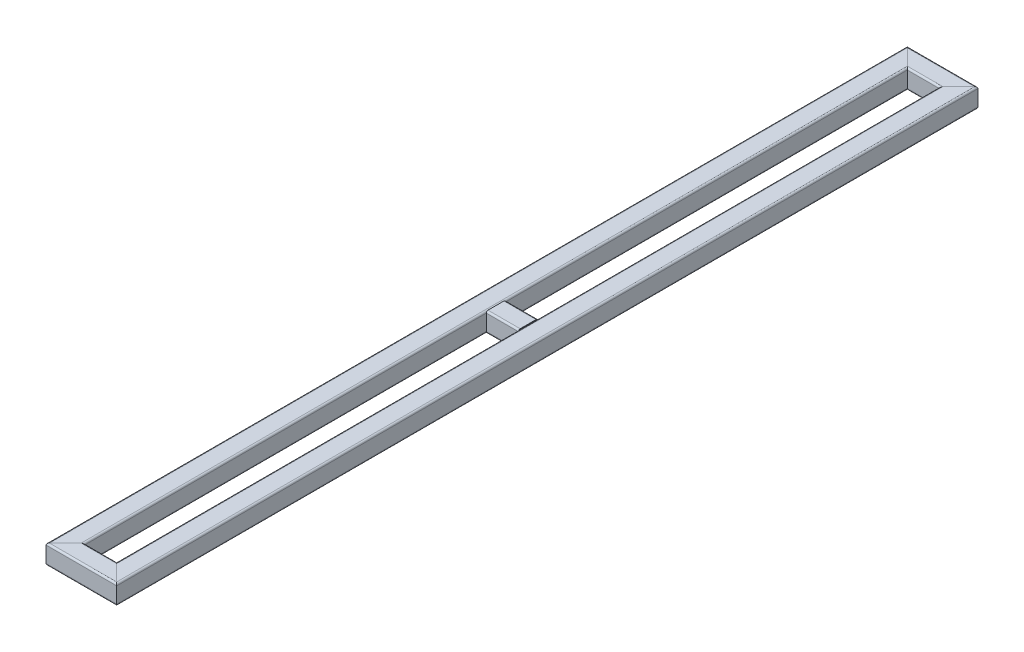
from build123d import *

# Parameters (mm, degrees)
EL_MENT_M_CANO_SOUD_1_DEPTH      = 1997.819805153
EL_MENT_M_CANO_SOUD_1_DEPTH_BACK = 32.819805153
EL_MENT_M_CANO_SOUD_1_2_DEPTH    = 185.639610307
EL_MENT_M_CANO_SOUD_1_3_DEPTH    = 2030.639610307
EL_MENT_M_CANO_SOUD_1_4_DEPTH    = 185.639610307
EL_MENT_M_CANO_SOUD_1_5_DEPTH    = 122


with BuildPart() as part:
    # Sketch11 → El_ment m_cano-soud_1 (new, two sides: drawn at the far end of the back side and taken through both)
    with BuildSketch(Plane.XY.offset(-1965).offset(-EL_MENT_M_CANO_SOUD_1_DEPTH_BACK)):
        with BuildLine():
            Line((-18.5, -22.5), (18.5, -22.5))
            ThreePointArc((18.5, -22.5), (21.328427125, -21.328427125), (22.5, -18.5))
            Line((22.5, -18.5), (22.5, 18.5))
            ThreePointArc((22.5, 18.5), (21.328427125, 21.328427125), (18.5, 22.5))
            Line((18.5, 22.5), (-18.5, 22.5))
            ThreePointArc((-18.5, 22.5), (-21.328427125, 21.328427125), (-22.5, 18.5))
            Line((-22.5, 18.5), (-22.5, -18.5))
            ThreePointArc((-22.5, -18.5), (-21.328427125, -21.328427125), (-18.5, -22.5))
        make_face()
        with BuildLine():
            Line((-18.5, -20.5), (18.5, -20.5))
            ThreePointArc((18.5, -20.5), (19.914213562, -19.914213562), (20.5, -18.5))
            Line((20.5, -18.5), (20.5, 18.5))
            ThreePointArc((20.5, 18.5), (19.914213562, 19.914213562), (18.5, 20.5))
            Line((18.5, 20.5), (-18.5, 20.5))
            ThreePointArc((-18.5, 20.5), (-19.914213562, 19.914213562), (-20.5, 18.5))
            Line((-20.5, 18.5), (-20.5, -18.5))
            ThreePointArc((-20.5, -18.5), (-19.914213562, -19.914213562), (-18.5, -20.5))
        make_face(mode=Mode.SUBTRACT)
    extrude(amount=EL_MENT_M_CANO_SOUD_1_DEPTH + EL_MENT_M_CANO_SOUD_1_DEPTH_BACK)

    # El_ment m_cano-soud_1 mitre 1
    split(bisect_by=Plane(origin=(0, 0, -1965), x_dir=(0, -1, 0), z_dir=(-0.707106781, 0, 0.707106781)), keep=Keep.TOP)

    # El_ment m_cano-soud_1 mitre 2
    split(bisect_by=Plane(origin=(0, 0, 0), x_dir=(0, -1, 0), z_dir=(-0.707106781, 0, -0.707106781)), keep=Keep.TOP)


with BuildPart() as body_2:
    # Sketch11 on segment 2 (on carried to segment 2) → El_ment m_cano-soud_1 2 (new body)
    with BuildSketch(Plane(origin=(-32.819805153, 0, 0), x_dir=(0, 0, -1), z_dir=(1, 0, 0))):
        with BuildLine():
            Line((-18.5, -22.5), (18.5, -22.5))
            ThreePointArc((18.5, -22.5), (21.328427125, -21.328427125), (22.5, -18.5))
            Line((22.5, -18.5), (22.5, 18.5))
            ThreePointArc((22.5, 18.5), (21.328427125, 21.328427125), (18.5, 22.5))
            Line((18.5, 22.5), (-18.5, 22.5))
            ThreePointArc((-18.5, 22.5), (-21.328427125, 21.328427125), (-22.5, 18.5))
            Line((-22.5, 18.5), (-22.5, -18.5))
            ThreePointArc((-22.5, -18.5), (-21.328427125, -21.328427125), (-18.5, -22.5))
        make_face()
        with BuildLine():
            Line((-18.5, -20.5), (18.5, -20.5))
            ThreePointArc((18.5, -20.5), (19.914213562, -19.914213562), (20.5, -18.5))
            Line((20.5, -18.5), (20.5, 18.5))
            ThreePointArc((20.5, 18.5), (19.914213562, 19.914213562), (18.5, 20.5))
            Line((18.5, 20.5), (-18.5, 20.5))
            ThreePointArc((-18.5, 20.5), (-19.914213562, 19.914213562), (-20.5, 18.5))
            Line((-20.5, 18.5), (-20.5, -18.5))
            ThreePointArc((-20.5, -18.5), (-19.914213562, -19.914213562), (-18.5, -20.5))
        make_face(mode=Mode.SUBTRACT)
    extrude(amount=EL_MENT_M_CANO_SOUD_1_2_DEPTH)

    # El_ment m_cano-soud_1 2 mitre 1
    split(bisect_by=Plane(origin=(0, 0, 0), x_dir=(0, 1, 0), z_dir=(0.707106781, 0, 0.707106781)), keep=Keep.TOP)

    # El_ment m_cano-soud_1 2 mitre 2
    split(bisect_by=Plane(origin=(120, 0, 0), x_dir=(0, -1, 0), z_dir=(-0.707106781, 0, 0.707106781)), keep=Keep.TOP)


with BuildPart() as body_3:
    # Sketch11 on segment 3 (on carried to segment 3) → El_ment m_cano-soud_1 3 (new body)
    with BuildSketch(Plane(origin=(120, 0, 32.819805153), x_dir=(-1, 0, 0), z_dir=(0, 0, -1))):
        with BuildLine():
            Line((-18.5, -22.5), (18.5, -22.5))
            ThreePointArc((18.5, -22.5), (21.328427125, -21.328427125), (22.5, -18.5))
            Line((22.5, -18.5), (22.5, 18.5))
            ThreePointArc((22.5, 18.5), (21.328427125, 21.328427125), (18.5, 22.5))
            Line((18.5, 22.5), (-18.5, 22.5))
            ThreePointArc((-18.5, 22.5), (-21.328427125, 21.328427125), (-22.5, 18.5))
            Line((-22.5, 18.5), (-22.5, -18.5))
            ThreePointArc((-22.5, -18.5), (-21.328427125, -21.328427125), (-18.5, -22.5))
        make_face()
        with BuildLine():
            Line((-18.5, -20.5), (18.5, -20.5))
            ThreePointArc((18.5, -20.5), (19.914213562, -19.914213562), (20.5, -18.5))
            Line((20.5, -18.5), (20.5, 18.5))
            ThreePointArc((20.5, 18.5), (19.914213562, 19.914213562), (18.5, 20.5))
            Line((18.5, 20.5), (-18.5, 20.5))
            ThreePointArc((-18.5, 20.5), (-19.914213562, 19.914213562), (-20.5, 18.5))
            Line((-20.5, 18.5), (-20.5, -18.5))
            ThreePointArc((-20.5, -18.5), (-19.914213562, -19.914213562), (-18.5, -20.5))
        make_face(mode=Mode.SUBTRACT)
    extrude(amount=EL_MENT_M_CANO_SOUD_1_3_DEPTH)

    # El_ment m_cano-soud_1 3 mitre 1
    split(bisect_by=Plane(origin=(120, 0, 0), x_dir=(0, 1, 0), z_dir=(0.707106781, 0, -0.707106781)), keep=Keep.TOP)

    # El_ment m_cano-soud_1 3 mitre 2
    split(bisect_by=Plane(origin=(120, 0, -1965), x_dir=(0, 1, 0), z_dir=(0.707106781, 0, 0.707106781)), keep=Keep.TOP)


with BuildPart() as body_4:
    # Sketch11 on segment 4 (on carried to segment 4) → El_ment m_cano-soud_1 4 (new body)
    with BuildSketch(Plane(origin=(152.819805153, 0, -1965), x_dir=(0, 0, 1), z_dir=(-1, 0, 0))):
        with BuildLine():
            Line((-18.5, -22.5), (18.5, -22.5))
            ThreePointArc((18.5, -22.5), (21.328427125, -21.328427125), (22.5, -18.5))
            Line((22.5, -18.5), (22.5, 18.5))
            ThreePointArc((22.5, 18.5), (21.328427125, 21.328427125), (18.5, 22.5))
            Line((18.5, 22.5), (-18.5, 22.5))
            ThreePointArc((-18.5, 22.5), (-21.328427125, 21.328427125), (-22.5, 18.5))
            Line((-22.5, 18.5), (-22.5, -18.5))
            ThreePointArc((-22.5, -18.5), (-21.328427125, -21.328427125), (-18.5, -22.5))
        make_face()
        with BuildLine():
            Line((-18.5, -20.5), (18.5, -20.5))
            ThreePointArc((18.5, -20.5), (19.914213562, -19.914213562), (20.5, -18.5))
            Line((20.5, -18.5), (20.5, 18.5))
            ThreePointArc((20.5, 18.5), (19.914213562, 19.914213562), (18.5, 20.5))
            Line((18.5, 20.5), (-18.5, 20.5))
            ThreePointArc((-18.5, 20.5), (-19.914213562, 19.914213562), (-20.5, 18.5))
            Line((-20.5, 18.5), (-20.5, -18.5))
            ThreePointArc((-20.5, -18.5), (-19.914213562, -19.914213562), (-18.5, -20.5))
        make_face(mode=Mode.SUBTRACT)
    extrude(amount=EL_MENT_M_CANO_SOUD_1_4_DEPTH)

    # El_ment m_cano-soud_1 4 mitre 1
    split(bisect_by=Plane(origin=(120, 0, -1965), x_dir=(0, -1, 0), z_dir=(-0.707106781, 0, -0.707106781)), keep=Keep.TOP)

    # El_ment m_cano-soud_1 4 mitre 2
    split(bisect_by=Plane(origin=(0, 0, -1965), x_dir=(0, 1, 0), z_dir=(0.707106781, 0, -0.707106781)), keep=Keep.TOP)


with BuildPart() as body_5:
    # Sketch11 on segment 5 (on carried to segment 5) → El_ment m_cano-soud_1 5 (new body)
    with BuildSketch(Plane(origin=(-1, 0, -982.5), x_dir=(0, 0, -1), z_dir=(1, 0, 0))):
        with BuildLine():
            Line((-18.5, -22.5), (18.5, -22.5))
            ThreePointArc((18.5, -22.5), (21.328427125, -21.328427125), (22.5, -18.5))
            Line((22.5, -18.5), (22.5, 18.5))
            ThreePointArc((22.5, 18.5), (21.328427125, 21.328427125), (18.5, 22.5))
            Line((18.5, 22.5), (-18.5, 22.5))
            ThreePointArc((-18.5, 22.5), (-21.328427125, 21.328427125), (-22.5, 18.5))
            Line((-22.5, 18.5), (-22.5, -18.5))
            ThreePointArc((-22.5, -18.5), (-21.328427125, -21.328427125), (-18.5, -22.5))
        make_face()
        with BuildLine():
            Line((-18.5, -20.5), (18.5, -20.5))
            ThreePointArc((18.5, -20.5), (19.914213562, -19.914213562), (20.5, -18.5))
            Line((20.5, -18.5), (20.5, 18.5))
            ThreePointArc((20.5, 18.5), (19.914213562, 19.914213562), (18.5, 20.5))
            Line((18.5, 20.5), (-18.5, 20.5))
            ThreePointArc((-18.5, 20.5), (-19.914213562, 19.914213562), (-20.5, 18.5))
            Line((-20.5, 18.5), (-20.5, -18.5))
            ThreePointArc((-20.5, -18.5), (-19.914213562, -19.914213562), (-18.5, -20.5))
        make_face(mode=Mode.SUBTRACT)
    extrude(amount=EL_MENT_M_CANO_SOUD_1_5_DEPTH)

    # El_ment m_cano-soud_1 5 mitre 1
    split(bisect_by=Plane(origin=(22.5, 0, -982.5), x_dir=(0, 1, 0), z_dir=(1, 0, 0)), keep=Keep.TOP)

    # El_ment m_cano-soud_1 5 mitre 2
    split(bisect_by=Plane(origin=(97.5, 0, -982.5), x_dir=(0, -1, 0), z_dir=(-1, 0, 0)), keep=Keep.TOP)


solid = Compound([part.part, body_2.part, body_3.part, body_4.part, body_5.part])
